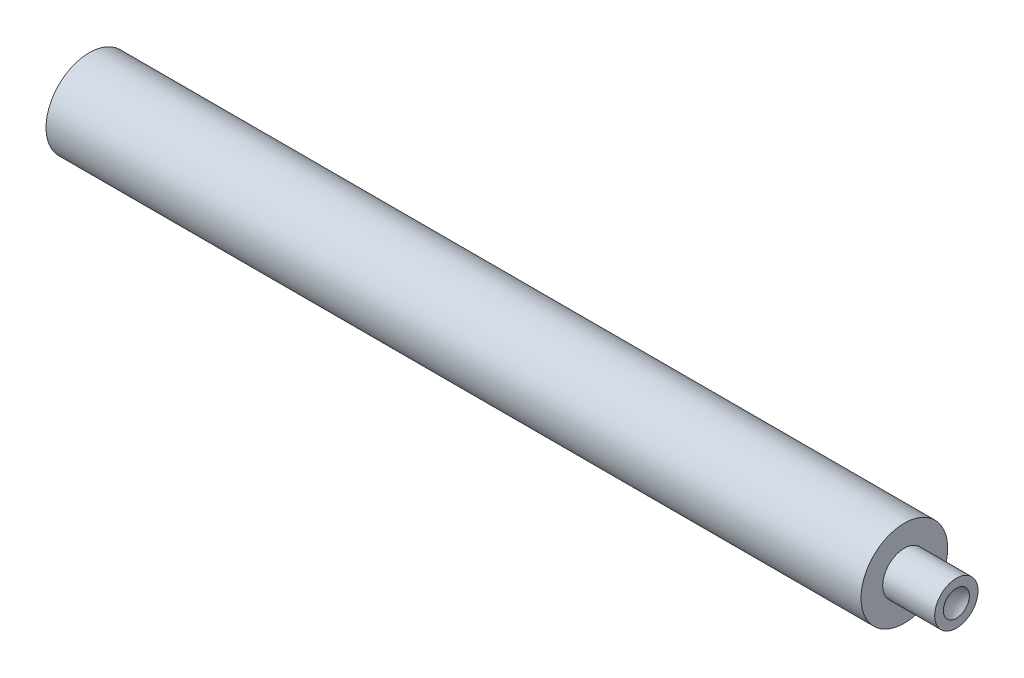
ISO-10303-21;
HEADER;
FILE_DESCRIPTION(('STEP AP214'),'2;1');
FILE_NAME('part.step','',(''),(''),'','','');
FILE_SCHEMA(('AUTOMOTIVE_DESIGN { 1 0 10303 214 1 1 1 1 }'));
ENDSEC;
DATA;
#1=APPLICATION_CONTEXT('core data for automotive mechanical design processes');
#2=APPLICATION_PROTOCOL_DEFINITION('international standard','automotive_design',2000,#1);
#3=PRODUCT_CONTEXT('',#1,'mechanical');
#4=PRODUCT('Part','Part','',(#3));
#5=PRODUCT_RELATED_PRODUCT_CATEGORY('part','',(#4));
#6=PRODUCT_DEFINITION_FORMATION('','',#4);
#7=PRODUCT_DEFINITION_CONTEXT('part definition',#1,'design');
#8=PRODUCT_DEFINITION('design','',#6,#7);
#9=PRODUCT_DEFINITION_SHAPE('','',#8);
#10=(LENGTH_UNIT() NAMED_UNIT(*) SI_UNIT(.MILLI.,.METRE.));
#11=(NAMED_UNIT(*) PLANE_ANGLE_UNIT() SI_UNIT($,.RADIAN.));
#12=(NAMED_UNIT(*) SI_UNIT($,.STERADIAN.) SOLID_ANGLE_UNIT());
#13=UNCERTAINTY_MEASURE_WITH_UNIT(LENGTH_MEASURE(1.E-05),#10,'distance_accuracy_value','');
#14=(GEOMETRIC_REPRESENTATION_CONTEXT(3) GLOBAL_UNCERTAINTY_ASSIGNED_CONTEXT((#13)) GLOBAL_UNIT_ASSIGNED_CONTEXT((#10,
#11,#12)) REPRESENTATION_CONTEXT('',''));
#15=CARTESIAN_POINT('',(0.,0.,0.));
#16=DIRECTION('',(0.,0.,1.));
#17=DIRECTION('',(1.,0.,0.));
#18=AXIS2_PLACEMENT_3D('',#15,#16,#17);
#19=CARTESIAN_POINT('',(50.6614378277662,0.,0.));
#20=DIRECTION('',(1.,0.,0.));
#21=DIRECTION('',(0.,1.,0.));
#22=AXIS2_PLACEMENT_3D('',#19,#20,#21);
#23=SPHERICAL_SURFACE('',#22,1.);
#24=CARTESIAN_POINT('',(49.6614378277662,0.,0.));
#25=VERTEX_POINT('',#24);
#26=VERTEX_LOOP('',#25);
#27=FACE_BOUND('',#26,.T.);
#28=CARTESIAN_POINT('',(50.,0.,0.));
#29=DIRECTION('',(1.,0.,0.));
#30=DIRECTION('',(0.,0.,-1.));
#31=AXIS2_PLACEMENT_3D('',#28,#29,#30);
#32=CIRCLE('',#31,0.749999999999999);
#33=CARTESIAN_POINT('',(50.,0.,-0.749999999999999));
#34=VERTEX_POINT('',#33);
#35=EDGE_CURVE('E21',#34,#34,#32,.F.);
#36=ORIENTED_EDGE('',*,*,#35,.F.);
#37=EDGE_LOOP('',(#36));
#38=FACE_BOUND('',#37,.T.);
#39=ADVANCED_FACE('F17',(#27,#38),#23,.F.);
#40=CARTESIAN_POINT('',(50.,-1.,0.));
#41=DIRECTION('',(1.,0.,0.));
#42=DIRECTION('',(0.,0.,-1.));
#43=AXIS2_PLACEMENT_3D('',#40,#41,#42);
#44=PLANE('',#43);
#45=ORIENTED_EDGE('',*,*,#35,.T.);
#46=EDGE_LOOP('',(#45));
#47=FACE_BOUND('',#46,.T.);
#48=CARTESIAN_POINT('',(50.,0.,0.));
#49=DIRECTION('',(-1.,0.,0.));
#50=DIRECTION('',(0.,0.,1.));
#51=AXIS2_PLACEMENT_3D('',#48,#49,#50);
#52=CIRCLE('',#51,1.25);
#53=CARTESIAN_POINT('',(50.,0.,1.25));
#54=VERTEX_POINT('',#53);
#55=EDGE_CURVE('E35',#54,#54,#52,.T.);
#56=ORIENTED_EDGE('',*,*,#55,.F.);
#57=EDGE_LOOP('',(#56));
#58=FACE_BOUND('',#57,.T.);
#59=ADVANCED_FACE('F31',(#47,#58),#44,.T.);
#60=CARTESIAN_POINT('',(48.5,0.,0.));
#61=DIRECTION('',(-1.,0.,0.));
#62=DIRECTION('',(0.,0.,1.));
#63=AXIS2_PLACEMENT_3D('',#60,#61,#62);
#64=CYLINDRICAL_SURFACE('',#63,1.25);
#65=ORIENTED_EDGE('',*,*,#55,.T.);
#66=EDGE_LOOP('',(#65));
#67=FACE_BOUND('',#66,.T.);
#68=CARTESIAN_POINT('',(47.,0.,0.));
#69=DIRECTION('',(-1.,0.,0.));
#70=DIRECTION('',(0.,0.,1.));
#71=AXIS2_PLACEMENT_3D('',#68,#69,#70);
#72=CIRCLE('',#71,1.25);
#73=CARTESIAN_POINT('',(47.,0.,1.25));
#74=VERTEX_POINT('',#73);
#75=EDGE_CURVE('E37',#74,#74,#72,.T.);
#76=ORIENTED_EDGE('',*,*,#75,.F.);
#77=EDGE_LOOP('',(#76));
#78=FACE_BOUND('',#77,.T.);
#79=ADVANCED_FACE('F52',(#67,#78),#64,.T.);
#80=CARTESIAN_POINT('',(0.,-1.25,0.));
#81=DIRECTION('',(-1.,0.,0.));
#82=DIRECTION('',(0.,0.,1.));
#83=AXIS2_PLACEMENT_3D('',#80,#81,#82);
#84=PLANE('',#83);
#85=CARTESIAN_POINT('',(0.,0.,0.));
#86=DIRECTION('',(-1.,0.,0.));
#87=DIRECTION('',(0.,0.,1.));
#88=AXIS2_PLACEMENT_3D('',#85,#86,#87);
#89=CIRCLE('',#88,2.5);
#90=CARTESIAN_POINT('',(0.,0.,2.5));
#91=VERTEX_POINT('',#90);
#92=EDGE_CURVE('E25',#91,#91,#89,.F.);
#93=ORIENTED_EDGE('',*,*,#92,.F.);
#94=EDGE_LOOP('',(#93));
#95=FACE_BOUND('',#94,.T.);
#96=ADVANCED_FACE('F49',(#95),#84,.T.);
#97=CARTESIAN_POINT('',(47.,-1.875,0.));
#98=DIRECTION('',(1.,0.,0.));
#99=DIRECTION('',(0.,0.,-1.));
#100=AXIS2_PLACEMENT_3D('',#97,#98,#99);
#101=PLANE('',#100);
#102=ORIENTED_EDGE('',*,*,#75,.T.);
#103=EDGE_LOOP('',(#102));
#104=FACE_BOUND('',#103,.T.);
#105=CARTESIAN_POINT('',(47.,0.,0.));
#106=DIRECTION('',(-1.,0.,0.));
#107=DIRECTION('',(0.,0.,1.));
#108=AXIS2_PLACEMENT_3D('',#105,#106,#107);
#109=CIRCLE('',#108,2.5);
#110=CARTESIAN_POINT('',(47.,0.,2.5));
#111=VERTEX_POINT('',#110);
#112=EDGE_CURVE('E11',#111,#111,#109,.T.);
#113=ORIENTED_EDGE('',*,*,#112,.F.);
#114=EDGE_LOOP('',(#113));
#115=FACE_BOUND('',#114,.T.);
#116=ADVANCED_FACE('F51',(#104,#115),#101,.T.);
#117=CARTESIAN_POINT('',(23.5,0.,0.));
#118=DIRECTION('',(-1.,0.,0.));
#119=DIRECTION('',(0.,0.,1.));
#120=AXIS2_PLACEMENT_3D('',#117,#118,#119);
#121=CYLINDRICAL_SURFACE('',#120,2.5);
#122=ORIENTED_EDGE('',*,*,#112,.T.);
#123=EDGE_LOOP('',(#122));
#124=FACE_BOUND('',#123,.T.);
#125=ORIENTED_EDGE('',*,*,#92,.T.);
#126=EDGE_LOOP('',(#125));
#127=FACE_BOUND('',#126,.T.);
#128=ADVANCED_FACE('F47',(#124,#127),#121,.T.);
#129=CLOSED_SHELL('',(#39,#59,#79,#96,#116,#128));
#130=MANIFOLD_SOLID_BREP('B1',#129);
#131=ADVANCED_BREP_SHAPE_REPRESENTATION('',(#18,#130),#14);
#132=SHAPE_DEFINITION_REPRESENTATION(#9,#131);
ENDSEC;
END-ISO-10303-21;
